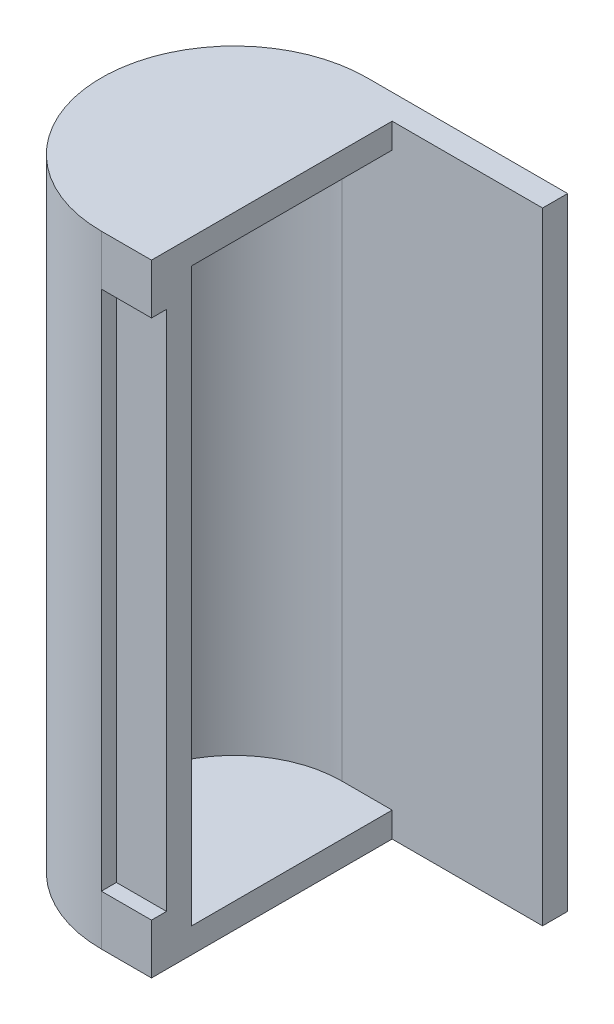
from build123d import *

# Parameters (mm, degrees)
SKETCH1_W               = 40
SKETCH1_H               = 124
BOSS_EXTRUDE1_DEPTH     = 5
BOSS_EXTRUDE3_DEPTH     = 124
SKETCH7_W               = 5
SKETCH7_H               = 124
BOSS_EXTRUDE4_DEPTH     = 10
SKETCH8_W               = 10
SKETCH8_H               = 104
CUT_EXTRUDE1_DEPTH      = 5
SKETCH10_W              = 10
SKETCH10_H              = 124
BOSS_EXTRUDE6_DEPTH     = 8
CUT_EXTRUDE5_DEPTH      = 4
CUT_EXTRUDE5_DEPTH_BACK = 3
SKETCH11_W              = 10
SKETCH11_H              = 104
BOSS_EXTRUDE7_DEPTH     = 5
BOSS_EXTRUDE8_START     = -5
BOSS_EXTRUDE8_DEPTH     = 5


with BuildPart() as part:
    # Sketch1 → Boss-Extrude1 (new body)
    with BuildSketch(Plane.XY):
        with Locations((-4.326133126, -47.594405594)):
            Rectangle(SKETCH1_W, SKETCH1_H)
    extrude(amount=BOSS_EXTRUDE1_DEPTH)

    # Sketch6 → Boss-Extrude3 (add)
    with BuildSketch(Plane(origin=(0, 14.405594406, 0), x_dir=(1, 0, 0), z_dir=(0, 1, 0))):
        with BuildLine():
            Line((-24.326133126, -48), (-24.326133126, -53))
            ThreePointArc((-24.326133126, -53), (-50.826133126, -26.5), (-24.326133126, 0))
            Line((-24.326133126, 0), (15.673866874, 0))
            Line((15.673866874, 0), (15.673866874, -5))
            Line((15.673866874, -5), (-24.326133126, -5))
            ThreePointArc((-24.326133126, -5), (-45.826133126, -26.5), (-24.326133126, -48))
        make_face()
    extrude(amount=-BOSS_EXTRUDE3_DEPTH)

    # Sketch7 → Boss-Extrude4 (add)
    with BuildSketch(Plane(origin=(-24.326133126, 0, 0), x_dir=(0, 0, -1), z_dir=(1, 0, 0))):
        with Locations((-50.5, -47.594405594)):
            Rectangle(SKETCH7_W, SKETCH7_H)
    extrude(amount=BOSS_EXTRUDE4_DEPTH)

    # Sketch8 → Cut-Extrude1 (cut)
    with BuildSketch(Plane.XY.offset(53)):
        with Locations((-19.326133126, -47.594405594)):
            Rectangle(SKETCH8_W, SKETCH8_H)
    extrude(amount=-CUT_EXTRUDE1_DEPTH, mode=Mode.SUBTRACT)

    # Sketch10 → Boss-Extrude6 (add)
    with BuildSketch(Plane.XY.offset(53)):
        with Locations((-19.326133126, -47.594405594)):
            Rectangle(SKETCH10_W, SKETCH10_H)
    extrude(amount=-BOSS_EXTRUDE6_DEPTH)

    # Sketch11 → Cut-Extrude5 (cut, two sides: drawn at the far end of the back side and taken through both)
    with BuildSketch(Plane.XY.offset(53).offset(-CUT_EXTRUDE5_DEPTH_BACK)):
        with Locations((-19.326133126, -47.594405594)):
            Rectangle(SKETCH11_W, SKETCH11_H)
    extrude(amount=CUT_EXTRUDE5_DEPTH + CUT_EXTRUDE5_DEPTH_BACK, mode=Mode.SUBTRACT)

    # Sketch12 → Boss-Extrude7 (add)
    with BuildSketch(Plane(origin=(0, 14.405594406, 0), x_dir=(1, 0, 0), z_dir=(0, 1, 0))):
        with BuildLine():
            Line((-14.326133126, -53), (-14.326133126, 0))
            Line((-14.326133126, 0), (-24.326133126, 0))
            ThreePointArc((-24.326133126, 0), (-50.826133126, -26.5), (-24.326133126, -53))
            Line((-24.326133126, -53), (-14.326133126, -53))
        make_face()
    extrude(amount=-BOSS_EXTRUDE7_DEPTH)

    # Sketch13 → Boss-Extrude8 (add)
    with BuildSketch(Plane.XZ.offset(109.594405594).offset(BOSS_EXTRUDE8_START)):
        with BuildLine():
            Line((-24.326133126, 53), (-14.326133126, 53))
            Line((-14.326133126, 53), (-14.326133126, 0))
            Line((-14.326133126, 0), (-24.326133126, 0))
            ThreePointArc((-24.326133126, 0), (-50.826133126, 26.5), (-24.326133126, 53))
        make_face()
    extrude(amount=BOSS_EXTRUDE8_DEPTH)


solid = part.part
